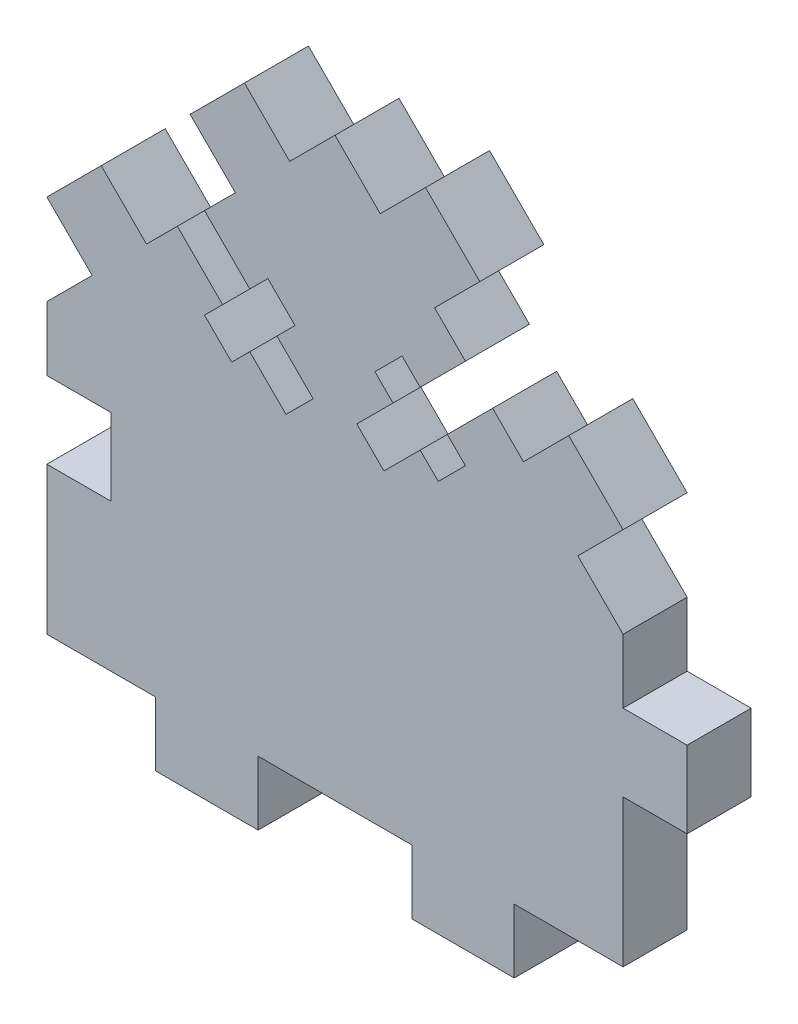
from build123d import *

# Parameters (mm, degrees)
SKETCH1_W           = 57.15
SKETCH1_H           = 28.575
BOSS_EXTRUDE2_DEPTH = 6.35
SKETCH31_W          = 6.35
SKETCH31_H          = 7.62
CUT_EXTRUDE1_DEPTH  = 6.35
SKETCH32_W          = 6.35
SKETCH32_H          = 7.62
BOSS_EXTRUDE3_DEPTH = 6.35
SKETCH33_W          = 10.16
SKETCH33_H          = 6.35
BOSS_EXTRUDE4_DEPTH = 6.35


with BuildPart() as part:
    # Sketch1 → Boss-Extrude2 (new body)
    with BuildSketch(Plane.XY):
        with Locations((-28.575, 14.2875)):
            Rectangle(SKETCH1_W, SKETCH1_H)
        Polygon((-57.15, 28.575), (0, 28.575), (-4.490128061, 33.065128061), (-9.878281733, 38.453281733), (-12.940461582, 41.515461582), (-16.41787739, 38.038045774), (-17.430589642, 37.025333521), (-15.634538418, 35.229282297), (-18.328615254, 32.535205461), (-20.124666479, 34.331256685), (-23.716768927, 30.739154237), (-26.410845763, 33.433231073), (-22.818743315, 37.025333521), (-24.614794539, 38.821384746), (-21.920717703, 41.515461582), (-20.124666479, 39.719410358), (-15.634538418, 44.209538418), (-18.696718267, 47.271718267), (-24.084871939, 52.659871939), (-28.575, 57.15), (-33.065128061, 52.659871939), (-38.453281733, 47.271718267), (-41.515461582, 44.209538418), (-37.025333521, 39.719410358), (-35.229282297, 41.515461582), (-32.535205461, 38.821384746), (-34.331256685, 37.025333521), (-30.739154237, 33.433231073), (-33.433231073, 30.739154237), (-37.025333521, 34.331256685), (-38.821384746, 32.535205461), (-41.515461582, 35.229282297), (-39.719410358, 37.025333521), (-44.209538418, 41.515461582), (-47.271718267, 38.453281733), (-52.659871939, 33.065128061), align=None)
        Polygon((-57.15, 37.555256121), (-52.659871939, 33.065128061), (-47.271718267, 38.453281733), (-51.761846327, 42.943409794), align=None)
        Polygon((-24.084871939, 52.659871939), (-18.696718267, 47.271718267), (-14.206590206, 51.761846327), (-19.594743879, 57.15), align=None)
        Polygon((-9.878281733, 38.453281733), (-4.490128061, 33.065128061), (0, 37.555256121), (-5.388153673, 42.943409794), align=None)
        Polygon((-42.943409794, 51.761846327), (-37.555256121, 57.15), (-33.065128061, 52.659871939), (-38.453281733, 47.271718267), align=None)
    extrude(amount=BOSS_EXTRUDE2_DEPTH)

    # Sketch31 → Cut-Extrude1 (cut)
    with BuildSketch(Plane.XY.offset(6.35)):
        with Locations((-53.975, 18.415)):
            Rectangle(SKETCH31_W, SKETCH31_H)
    extrude(amount=-CUT_EXTRUDE1_DEPTH, mode=Mode.SUBTRACT)

    # Sketch32 → Boss-Extrude3 (add)
    with BuildSketch(Plane(origin=(0, 0, 0), x_dir=(0, 0, -1), z_dir=(1, 0, 0))):
        with Locations((-3.175, 18.415)):
            Rectangle(SKETCH32_W, SKETCH32_H)
    extrude(amount=BOSS_EXTRUDE3_DEPTH)

    # Sketch33 → Boss-Extrude4 (add)
    with BuildSketch(Plane.XZ):
        with Locations((-41.275, 3.175)):
            Rectangle(SKETCH33_W, SKETCH33_H)
        with Locations((-15.875, 3.175)):
            Rectangle(SKETCH33_W, SKETCH33_H)
    extrude(amount=BOSS_EXTRUDE4_DEPTH)


solid = part.part
